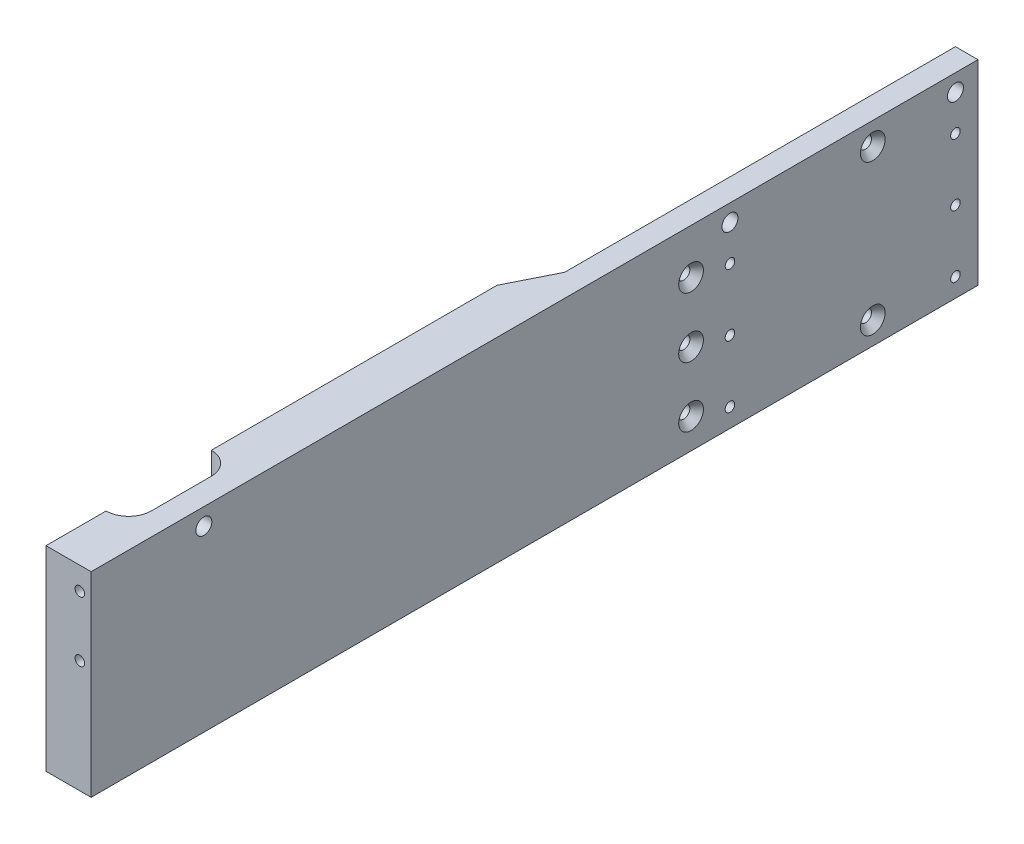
ISO-10303-21;
HEADER;
FILE_DESCRIPTION(('STEP AP214'),'2;1');
FILE_NAME('part.step','',(''),(''),'','','');
FILE_SCHEMA(('AUTOMOTIVE_DESIGN { 1 0 10303 214 1 1 1 1 }'));
ENDSEC;
DATA;
#1=APPLICATION_CONTEXT('core data for automotive mechanical design processes');
#2=APPLICATION_PROTOCOL_DEFINITION('international standard','automotive_design',2000,#1);
#3=PRODUCT_CONTEXT('',#1,'mechanical');
#4=PRODUCT('Part','Part','',(#3));
#5=PRODUCT_RELATED_PRODUCT_CATEGORY('part','',(#4));
#6=PRODUCT_DEFINITION_FORMATION('','',#4);
#7=PRODUCT_DEFINITION_CONTEXT('part definition',#1,'design');
#8=PRODUCT_DEFINITION('design','',#6,#7);
#9=PRODUCT_DEFINITION_SHAPE('','',#8);
#10=(LENGTH_UNIT() NAMED_UNIT(*) SI_UNIT(.MILLI.,.METRE.));
#11=(NAMED_UNIT(*) PLANE_ANGLE_UNIT() SI_UNIT($,.RADIAN.));
#12=(NAMED_UNIT(*) SI_UNIT($,.STERADIAN.) SOLID_ANGLE_UNIT());
#13=UNCERTAINTY_MEASURE_WITH_UNIT(LENGTH_MEASURE(1.E-05),#10,'distance_accuracy_value','');
#14=(GEOMETRIC_REPRESENTATION_CONTEXT(3) GLOBAL_UNCERTAINTY_ASSIGNED_CONTEXT((#13)) GLOBAL_UNIT_ASSIGNED_CONTEXT((#10,
#11,#12)) REPRESENTATION_CONTEXT('',''));
#15=CARTESIAN_POINT('',(0.,0.,0.));
#16=DIRECTION('',(0.,0.,1.));
#17=DIRECTION('',(1.,0.,0.));
#18=AXIS2_PLACEMENT_3D('',#15,#16,#17);
#19=CARTESIAN_POINT('',(72.898,48.4187500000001,-25.4));
#20=DIRECTION('',(1.,0.,0.));
#21=DIRECTION('',(0.,0.,-1.));
#22=AXIS2_PLACEMENT_3D('',#19,#20,#21);
#23=PLANE('',#22);
#24=DIRECTION('',(0.,0.,-1.));
#25=VECTOR('',#24,1.);
#26=CARTESIAN_POINT('',(72.898,-34.1376,-25.4));
#27=LINE('',#26,#25);
#28=CARTESIAN_POINT('',(72.898,-34.1376,-95.2499999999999));
#29=VERTEX_POINT('',#28);
#30=CARTESIAN_POINT('',(72.898,-34.1376,-215.9));
#31=VERTEX_POINT('',#30);
#32=EDGE_CURVE('E199',#29,#31,#27,.T.);
#33=ORIENTED_EDGE('',*,*,#32,.F.);
#34=DIRECTION('',(0.,-1.,0.));
#35=VECTOR('',#34,1.);
#36=CARTESIAN_POINT('',(72.898,48.4188000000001,-95.2499999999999));
#37=LINE('',#36,#35);
#38=CARTESIAN_POINT('',(72.898,48.4187500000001,-95.2499999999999));
#39=VERTEX_POINT('',#38);
#40=EDGE_CURVE('E11',#29,#39,#37,.F.);
#41=ORIENTED_EDGE('',*,*,#40,.T.);
#42=DIRECTION('',(0.,0.,-1.));
#43=VECTOR('',#42,1.);
#44=CARTESIAN_POINT('',(72.898,48.4187500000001,-25.4));
#45=LINE('',#44,#43);
#46=CARTESIAN_POINT('',(72.898,48.4187500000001,-215.9));
#47=VERTEX_POINT('',#46);
#48=EDGE_CURVE('E202',#39,#47,#45,.T.);
#49=ORIENTED_EDGE('',*,*,#48,.T.);
#50=DIRECTION('',(0.,-1.,0.));
#51=VECTOR('',#50,1.);
#52=CARTESIAN_POINT('',(72.898,69.7172974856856,-215.9));
#53=LINE('',#52,#51);
#54=EDGE_CURVE('E217',#47,#31,#53,.T.);
#55=ORIENTED_EDGE('',*,*,#54,.T.);
#56=EDGE_LOOP('',(#33,#41,#49,#55));
#57=FACE_BOUND('',#56,.T.);
#58=ADVANCED_FACE('F42',(#57),#23,.F.);
#59=CARTESIAN_POINT('',(82.423,-34.1376,-215.9));
#60=DIRECTION('',(1.,0.,0.));
#61=DIRECTION('',(0.,0.,-1.));
#62=AXIS2_PLACEMENT_3D('',#59,#60,#61);
#63=PLANE('',#62);
#64=CARTESIAN_POINT('',(82.423,38.8937500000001,-355.6));
#65=DIRECTION('',(1.,0.,0.));
#66=DIRECTION('',(0.,0.,-1.));
#67=AXIS2_PLACEMENT_3D('',#64,#65,#66);
#68=CIRCLE('',#67,2.55269999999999);
#69=CARTESIAN_POINT('',(82.423,38.8937500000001,-358.1527));
#70=VERTEX_POINT('',#69);
#71=EDGE_CURVE('E46',#70,#70,#68,.T.);
#72=ORIENTED_EDGE('',*,*,#71,.T.);
#73=EDGE_LOOP('',(#72));
#74=FACE_BOUND('',#73,.T.);
#75=CARTESIAN_POINT('',(82.423,-24.6126,-355.6));
#76=DIRECTION('',(1.,0.,0.));
#77=DIRECTION('',(0.,0.,-1.));
#78=AXIS2_PLACEMENT_3D('',#75,#76,#77);
#79=CIRCLE('',#78,2.55269999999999);
#80=CARTESIAN_POINT('',(82.423,-24.6126,-358.1527));
#81=VERTEX_POINT('',#80);
#82=EDGE_CURVE('E258',#81,#81,#79,.T.);
#83=ORIENTED_EDGE('',*,*,#82,.T.);
#84=EDGE_LOOP('',(#83));
#85=FACE_BOUND('',#84,.T.);
#86=CARTESIAN_POINT('',(82.423,-21.4376,-278.8412));
#87=DIRECTION('',(1.,0.,0.));
#88=DIRECTION('',(0.,0.,-1.));
#89=AXIS2_PLACEMENT_3D('',#86,#87,#88);
#90=CIRCLE('',#89,2.55269999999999);
#91=CARTESIAN_POINT('',(82.423,-21.4376,-281.3939));
#92=VERTEX_POINT('',#91);
#93=EDGE_CURVE('E254',#92,#92,#90,.T.);
#94=ORIENTED_EDGE('',*,*,#93,.T.);
#95=EDGE_LOOP('',(#94));
#96=FACE_BOUND('',#95,.T.);
#97=CARTESIAN_POINT('',(82.423,3.96239999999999,-278.8412));
#98=DIRECTION('',(1.,0.,0.));
#99=DIRECTION('',(0.,0.,-1.));
#100=AXIS2_PLACEMENT_3D('',#97,#98,#99);
#101=CIRCLE('',#100,2.55269999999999);
#102=CARTESIAN_POINT('',(82.423,3.96239999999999,-281.3939));
#103=VERTEX_POINT('',#102);
#104=EDGE_CURVE('E249',#103,#103,#101,.T.);
#105=ORIENTED_EDGE('',*,*,#104,.T.);
#106=EDGE_LOOP('',(#105));
#107=FACE_BOUND('',#106,.T.);
#108=CARTESIAN_POINT('',(82.423,29.3624,-278.8412));
#109=DIRECTION('',(1.,0.,0.));
#110=DIRECTION('',(0.,0.,-1.));
#111=AXIS2_PLACEMENT_3D('',#108,#109,#110);
#112=CIRCLE('',#111,2.55269999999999);
#113=CARTESIAN_POINT('',(82.423,29.3624,-281.3939));
#114=VERTEX_POINT('',#113);
#115=EDGE_CURVE('E243',#114,#114,#112,.T.);
#116=ORIENTED_EDGE('',*,*,#115,.T.);
#117=EDGE_LOOP('',(#116));
#118=FACE_BOUND('',#117,.T.);
#119=CARTESIAN_POINT('',(82.423,41.275,-390.525));
#120=DIRECTION('',(1.,0.,0.));
#121=DIRECTION('',(0.,0.,-1.));
#122=AXIS2_PLACEMENT_3D('',#119,#120,#121);
#123=CIRCLE('',#122,3.37819999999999);
#124=CARTESIAN_POINT('',(82.423,41.275,-393.9032));
#125=VERTEX_POINT('',#124);
#126=EDGE_CURVE('E209',#125,#125,#123,.T.);
#127=ORIENTED_EDGE('',*,*,#126,.T.);
#128=EDGE_LOOP('',(#127));
#129=FACE_BOUND('',#128,.T.);
#130=CARTESIAN_POINT('',(82.423,41.275,-295.275));
#131=DIRECTION('',(1.,0.,0.));
#132=DIRECTION('',(0.,0.,-1.));
#133=AXIS2_PLACEMENT_3D('',#130,#131,#132);
#134=CIRCLE('',#133,3.37819999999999);
#135=CARTESIAN_POINT('',(82.423,41.275,-298.6532));
#136=VERTEX_POINT('',#135);
#137=EDGE_CURVE('E214',#136,#136,#134,.T.);
#138=ORIENTED_EDGE('',*,*,#137,.T.);
#139=EDGE_LOOP('',(#138));
#140=FACE_BOUND('',#139,.T.);
#141=CARTESIAN_POINT('',(82.423,26.19375,-390.525));
#142=DIRECTION('',(1.,0.,0.));
#143=DIRECTION('',(0.,0.,-1.));
#144=AXIS2_PLACEMENT_3D('',#141,#142,#143);
#145=CIRCLE('',#144,2.0193);
#146=CARTESIAN_POINT('',(82.423,26.19375,-392.5443));
#147=VERTEX_POINT('',#146);
#148=EDGE_CURVE('E441',#147,#147,#145,.T.);
#149=ORIENTED_EDGE('',*,*,#148,.T.);
#150=EDGE_LOOP('',(#149));
#151=FACE_BOUND('',#150,.T.);
#152=CARTESIAN_POINT('',(82.423,-26.19375,-390.525));
#153=DIRECTION('',(1.,0.,0.));
#154=DIRECTION('',(0.,0.,-1.));
#155=AXIS2_PLACEMENT_3D('',#152,#153,#154);
#156=CIRCLE('',#155,2.0193);
#157=CARTESIAN_POINT('',(82.423,-26.19375,-392.5443));
#158=VERTEX_POINT('',#157);
#159=EDGE_CURVE('E445',#158,#158,#156,.T.);
#160=ORIENTED_EDGE('',*,*,#159,.T.);
#161=EDGE_LOOP('',(#160));
#162=FACE_BOUND('',#161,.T.);
#163=CARTESIAN_POINT('',(82.423,26.19375,-295.275));
#164=DIRECTION('',(1.,0.,0.));
#165=DIRECTION('',(0.,0.,-1.));
#166=AXIS2_PLACEMENT_3D('',#163,#164,#165);
#167=CIRCLE('',#166,2.0193);
#168=CARTESIAN_POINT('',(82.423,26.19375,-297.2943));
#169=VERTEX_POINT('',#168);
#170=EDGE_CURVE('E449',#169,#169,#167,.T.);
#171=ORIENTED_EDGE('',*,*,#170,.T.);
#172=EDGE_LOOP('',(#171));
#173=FACE_BOUND('',#172,.T.);
#174=CARTESIAN_POINT('',(82.423,-26.19375,-295.275));
#175=DIRECTION('',(1.,0.,0.));
#176=DIRECTION('',(0.,0.,-1.));
#177=AXIS2_PLACEMENT_3D('',#174,#175,#176);
#178=CIRCLE('',#177,2.0193);
#179=CARTESIAN_POINT('',(82.423,-26.19375,-297.2943));
#180=VERTEX_POINT('',#179);
#181=EDGE_CURVE('E453',#180,#180,#178,.T.);
#182=ORIENTED_EDGE('',*,*,#181,.T.);
#183=EDGE_LOOP('',(#182));
#184=FACE_BOUND('',#183,.T.);
#185=CARTESIAN_POINT('',(82.423,0.,-390.525));
#186=DIRECTION('',(1.,0.,0.));
#187=DIRECTION('',(0.,0.,-1.));
#188=AXIS2_PLACEMENT_3D('',#185,#186,#187);
#189=CIRCLE('',#188,2.0193);
#190=CARTESIAN_POINT('',(82.423,0.,-392.5443));
#191=VERTEX_POINT('',#190);
#192=EDGE_CURVE('E457',#191,#191,#189,.T.);
#193=ORIENTED_EDGE('',*,*,#192,.T.);
#194=EDGE_LOOP('',(#193));
#195=FACE_BOUND('',#194,.T.);
#196=CARTESIAN_POINT('',(82.423,0.,-295.275));
#197=DIRECTION('',(1.,0.,0.));
#198=DIRECTION('',(0.,0.,-1.));
#199=AXIS2_PLACEMENT_3D('',#196,#197,#198);
#200=CIRCLE('',#199,2.0193);
#201=CARTESIAN_POINT('',(82.423,0.,-297.2943));
#202=VERTEX_POINT('',#201);
#203=EDGE_CURVE('E460',#202,#202,#200,.T.);
#204=ORIENTED_EDGE('',*,*,#203,.T.);
#205=EDGE_LOOP('',(#204));
#206=FACE_BOUND('',#205,.T.);
#207=DIRECTION('',(0.,-1.,0.));
#208=VECTOR('',#207,1.);
#209=CARTESIAN_POINT('',(82.423,69.7172974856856,-234.95));
#210=LINE('',#209,#208);
#211=CARTESIAN_POINT('',(82.423,48.4187500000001,-234.95));
#212=VERTEX_POINT('',#211);
#213=CARTESIAN_POINT('',(82.423,-34.1376,-234.95));
#214=VERTEX_POINT('',#213);
#215=EDGE_CURVE('E67',#212,#214,#210,.T.);
#216=ORIENTED_EDGE('',*,*,#215,.F.);
#217=DIRECTION('',(0.,0.,1.));
#218=VECTOR('',#217,1.);
#219=CARTESIAN_POINT('',(82.423,48.4187500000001,-215.9));
#220=LINE('',#219,#218);
#221=CARTESIAN_POINT('',(82.423,48.4187500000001,-400.05));
#222=VERTEX_POINT('',#221);
#223=EDGE_CURVE('E498',#222,#212,#220,.T.);
#224=ORIENTED_EDGE('',*,*,#223,.F.);
#225=DIRECTION('',(0.,1.,0.));
#226=VECTOR('',#225,1.);
#227=CARTESIAN_POINT('',(82.423,48.4187500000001,-400.05));
#228=LINE('',#227,#226);
#229=CARTESIAN_POINT('',(82.423,-34.1376,-400.05));
#230=VERTEX_POINT('',#229);
#231=EDGE_CURVE('E494',#230,#222,#228,.T.);
#232=ORIENTED_EDGE('',*,*,#231,.F.);
#233=DIRECTION('',(0.,0.,-1.));
#234=VECTOR('',#233,1.);
#235=CARTESIAN_POINT('',(82.423,-34.1376,-215.9));
#236=LINE('',#235,#234);
#237=EDGE_CURVE('E223',#214,#230,#236,.T.);
#238=ORIENTED_EDGE('',*,*,#237,.F.);
#239=EDGE_LOOP('',(#216,#224,#232,#238));
#240=FACE_BOUND('',#239,.T.);
#241=ADVANCED_FACE('F311',(#74,#85,#96,#107,#118,#129,#140,#151,#162,#173,#184,#195,#206,#240),
#63,.F.);
#242=CARTESIAN_POINT('',(82.423,48.4187500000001,-215.9));
#243=DIRECTION('',(0.,1.,0.));
#244=DIRECTION('',(0.,0.,1.));
#245=AXIS2_PLACEMENT_3D('',#242,#243,#244);
#246=PLANE('',#245);
#247=CARTESIAN_POINT('',(72.898,48.41875,-85.7249999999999));
#248=DIRECTION('',(0.,1.,0.));
#249=DIRECTION('',(0.,0.,1.));
#250=AXIS2_PLACEMENT_3D('',#247,#248,#249);
#251=CIRCLE('',#250,9.52500000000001);
#252=CARTESIAN_POINT('',(82.423,48.41875,-85.7249999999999));
#253=VERTEX_POINT('',#252);
#254=EDGE_CURVE('E162',#253,#39,#251,.T.);
#255=ORIENTED_EDGE('',*,*,#254,.F.);
#256=DIRECTION('',(0.,0.,-1.));
#257=VECTOR('',#256,1.);
#258=CARTESIAN_POINT('',(82.423,48.4187500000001,-215.9));
#259=LINE('',#258,#257);
#260=CARTESIAN_POINT('',(82.423,48.41875,-60.3249999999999));
#261=VERTEX_POINT('',#260);
#262=EDGE_CURVE('E141',#261,#253,#259,.T.);
#263=ORIENTED_EDGE('',*,*,#262,.F.);
#264=CARTESIAN_POINT('',(72.898,48.41875,-60.3249999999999));
#265=DIRECTION('',(0.,1.,0.));
#266=DIRECTION('',(0.,0.,1.));
#267=AXIS2_PLACEMENT_3D('',#264,#265,#266);
#268=CIRCLE('',#267,9.52500000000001);
#269=CARTESIAN_POINT('',(72.898,48.4187500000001,-50.7999999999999));
#270=VERTEX_POINT('',#269);
#271=EDGE_CURVE('E159',#270,#261,#268,.T.);
#272=ORIENTED_EDGE('',*,*,#271,.F.);
#273=CARTESIAN_POINT('',(72.898,48.4187500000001,-25.4));
#274=VERTEX_POINT('',#273);
#275=EDGE_CURVE('E203',#274,#270,#45,.T.);
#276=ORIENTED_EDGE('',*,*,#275,.F.);
#277=DIRECTION('',(-1.,0.,0.));
#278=VECTOR('',#277,1.);
#279=CARTESIAN_POINT('',(91.948,48.4187500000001,-25.4));
#280=LINE('',#279,#278);
#281=CARTESIAN_POINT('',(91.948,48.4187500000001,-25.4));
#282=VERTEX_POINT('',#281);
#283=EDGE_CURVE('E195',#282,#274,#280,.T.);
#284=ORIENTED_EDGE('',*,*,#283,.F.);
#285=DIRECTION('',(0.,0.,1.));
#286=VECTOR('',#285,1.);
#287=CARTESIAN_POINT('',(91.948,48.4187500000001,-215.9));
#288=LINE('',#287,#286);
#289=CARTESIAN_POINT('',(91.948,48.4187500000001,-400.05));
#290=VERTEX_POINT('',#289);
#291=EDGE_CURVE('E507',#290,#282,#288,.T.);
#292=ORIENTED_EDGE('',*,*,#291,.F.);
#293=DIRECTION('',(1.,0.,0.));
#294=VECTOR('',#293,1.);
#295=CARTESIAN_POINT('',(82.423,48.4187500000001,-400.05));
#296=LINE('',#295,#294);
#297=EDGE_CURVE('E241',#222,#290,#296,.T.);
#298=ORIENTED_EDGE('',*,*,#297,.F.);
#299=ORIENTED_EDGE('',*,*,#223,.T.);
#300=DIRECTION('',(-0.447213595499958,0.,0.894427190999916));
#301=VECTOR('',#300,1.);
#302=CARTESIAN_POINT('',(72.898,48.4187500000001,-215.9));
#303=LINE('',#302,#301);
#304=EDGE_CURVE('E222',#212,#47,#303,.T.);
#305=ORIENTED_EDGE('',*,*,#304,.T.);
#306=ORIENTED_EDGE('',*,*,#48,.F.);
#307=EDGE_LOOP('',(#255,#263,#272,#276,#284,#292,#298,#299,#305,#306));
#308=FACE_BOUND('',#307,.T.);
#309=ADVANCED_FACE('F318',(#308),#246,.T.);
#310=CARTESIAN_POINT('',(82.423,48.4187500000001,-400.05));
#311=DIRECTION('',(0.,0.,-1.));
#312=DIRECTION('',(-1.,0.,0.));
#313=AXIS2_PLACEMENT_3D('',#310,#311,#312);
#314=PLANE('',#313);
#315=DIRECTION('',(0.,1.,0.));
#316=VECTOR('',#315,1.);
#317=CARTESIAN_POINT('',(91.948,48.4187500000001,-400.05));
#318=LINE('',#317,#316);
#319=CARTESIAN_POINT('',(91.948,-34.1376,-400.05));
#320=VERTEX_POINT('',#319);
#321=EDGE_CURVE('E509',#320,#290,#318,.T.);
#322=ORIENTED_EDGE('',*,*,#321,.F.);
#323=DIRECTION('',(1.,0.,0.));
#324=VECTOR('',#323,1.);
#325=CARTESIAN_POINT('',(82.423,-34.1376,-400.05));
#326=LINE('',#325,#324);
#327=EDGE_CURVE('E504',#230,#320,#326,.T.);
#328=ORIENTED_EDGE('',*,*,#327,.F.);
#329=ORIENTED_EDGE('',*,*,#231,.T.);
#330=ORIENTED_EDGE('',*,*,#297,.T.);
#331=EDGE_LOOP('',(#322,#328,#329,#330));
#332=FACE_BOUND('',#331,.T.);
#333=ADVANCED_FACE('F387',(#332),#314,.T.);
#334=CARTESIAN_POINT('',(82.423,-34.1376,-215.9));
#335=DIRECTION('',(0.,-1.,0.));
#336=DIRECTION('',(0.,0.,-1.));
#337=AXIS2_PLACEMENT_3D('',#334,#335,#336);
#338=PLANE('',#337);
#339=CARTESIAN_POINT('',(72.898,-34.1376,-85.7249999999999));
#340=DIRECTION('',(0.,-1.,0.));
#341=DIRECTION('',(0.,0.,-1.));
#342=AXIS2_PLACEMENT_3D('',#339,#340,#341);
#343=CIRCLE('',#342,9.52500000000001);
#344=CARTESIAN_POINT('',(82.423,-34.1376,-85.7249999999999));
#345=VERTEX_POINT('',#344);
#346=EDGE_CURVE('E147',#29,#345,#343,.T.);
#347=ORIENTED_EDGE('',*,*,#346,.F.);
#348=ORIENTED_EDGE('',*,*,#32,.T.);
#349=DIRECTION('',(-0.447213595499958,0.,0.894427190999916));
#350=VECTOR('',#349,1.);
#351=CARTESIAN_POINT('',(72.898,-34.1376,-215.9));
#352=LINE('',#351,#350);
#353=EDGE_CURVE('E226',#214,#31,#352,.T.);
#354=ORIENTED_EDGE('',*,*,#353,.F.);
#355=ORIENTED_EDGE('',*,*,#237,.T.);
#356=ORIENTED_EDGE('',*,*,#327,.T.);
#357=DIRECTION('',(0.,0.,-1.));
#358=VECTOR('',#357,1.);
#359=CARTESIAN_POINT('',(91.948,-34.1376,-215.9));
#360=LINE('',#359,#358);
#361=CARTESIAN_POINT('',(91.948,-34.1376,-25.4));
#362=VERTEX_POINT('',#361);
#363=EDGE_CURVE('E491',#362,#320,#360,.T.);
#364=ORIENTED_EDGE('',*,*,#363,.F.);
#365=DIRECTION('',(1.,0.,0.));
#366=VECTOR('',#365,1.);
#367=CARTESIAN_POINT('',(72.898,-34.1376,-25.4));
#368=LINE('',#367,#366);
#369=CARTESIAN_POINT('',(72.898,-34.1376,-25.4));
#370=VERTEX_POINT('',#369);
#371=EDGE_CURVE('E189',#370,#362,#368,.T.);
#372=ORIENTED_EDGE('',*,*,#371,.F.);
#373=CARTESIAN_POINT('',(72.898,-34.1376,-50.7999999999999));
#374=VERTEX_POINT('',#373);
#375=EDGE_CURVE('E200',#370,#374,#27,.T.);
#376=ORIENTED_EDGE('',*,*,#375,.T.);
#377=CARTESIAN_POINT('',(72.898,-34.1376,-60.3249999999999));
#378=DIRECTION('',(0.,-1.,0.));
#379=DIRECTION('',(0.,0.,-1.));
#380=AXIS2_PLACEMENT_3D('',#377,#378,#379);
#381=CIRCLE('',#380,9.52500000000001);
#382=CARTESIAN_POINT('',(82.423,-34.1376,-60.3249999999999));
#383=VERTEX_POINT('',#382);
#384=EDGE_CURVE('E59',#383,#374,#381,.T.);
#385=ORIENTED_EDGE('',*,*,#384,.F.);
#386=DIRECTION('',(0.,0.,1.));
#387=VECTOR('',#386,1.);
#388=CARTESIAN_POINT('',(82.423,-34.1376,-85.7249999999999));
#389=LINE('',#388,#387);
#390=EDGE_CURVE('E139',#345,#383,#389,.T.);
#391=ORIENTED_EDGE('',*,*,#390,.F.);
#392=EDGE_LOOP('',(#347,#348,#354,#355,#356,#364,#372,#376,#385,#391));
#393=FACE_BOUND('',#392,.T.);
#394=CARTESIAN_POINT('',(87.1855,-34.1376,-66.675));
#395=DIRECTION('',(0.,-1.,0.));
#396=DIRECTION('',(0.,0.,-1.));
#397=AXIS2_PLACEMENT_3D('',#394,#395,#396);
#398=CIRCLE('',#397,2.01929999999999);
#399=CARTESIAN_POINT('',(87.1855,-34.1376,-68.6943));
#400=VERTEX_POINT('',#399);
#401=EDGE_CURVE('E177',#400,#400,#398,.T.);
#402=ORIENTED_EDGE('',*,*,#401,.F.);
#403=EDGE_LOOP('',(#402));
#404=FACE_BOUND('',#403,.T.);
#405=CARTESIAN_POINT('',(87.1855,-34.1376,-149.225));
#406=DIRECTION('',(0.,-1.,0.));
#407=DIRECTION('',(0.,0.,-1.));
#408=AXIS2_PLACEMENT_3D('',#405,#406,#407);
#409=CIRCLE('',#408,2.01929999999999);
#410=CARTESIAN_POINT('',(87.1855,-34.1376,-151.2443));
#411=VERTEX_POINT('',#410);
#412=EDGE_CURVE('E183',#411,#411,#409,.T.);
#413=ORIENTED_EDGE('',*,*,#412,.F.);
#414=EDGE_LOOP('',(#413));
#415=FACE_BOUND('',#414,.T.);
#416=ADVANCED_FACE('F44',(#393,#404,#415),#338,.T.);
#417=CARTESIAN_POINT('',(91.948,-34.1376,-215.9));
#418=DIRECTION('',(1.,0.,0.));
#419=DIRECTION('',(0.,0.,-1.));
#420=AXIS2_PLACEMENT_3D('',#417,#418,#419);
#421=PLANE('',#420);
#422=CARTESIAN_POINT('',(91.948,38.8937500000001,-355.6));
#423=DIRECTION('',(1.,0.,0.));
#424=DIRECTION('',(0.,0.,-1.));
#425=AXIS2_PLACEMENT_3D('',#422,#423,#424);
#426=CIRCLE('',#425,5.2197);
#427=CARTESIAN_POINT('',(91.948,38.8937500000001,-360.8197));
#428=VERTEX_POINT('',#427);
#429=EDGE_CURVE('E776',#428,#428,#426,.T.);
#430=ORIENTED_EDGE('',*,*,#429,.F.);
#431=EDGE_LOOP('',(#430));
#432=FACE_BOUND('',#431,.T.);
#433=CARTESIAN_POINT('',(91.948,-24.6126,-355.6));
#434=DIRECTION('',(1.,0.,0.));
#435=DIRECTION('',(0.,0.,-1.));
#436=AXIS2_PLACEMENT_3D('',#433,#434,#435);
#437=CIRCLE('',#436,5.2197);
#438=CARTESIAN_POINT('',(91.948,-24.6126,-360.8197));
#439=VERTEX_POINT('',#438);
#440=EDGE_CURVE('E268',#439,#439,#437,.T.);
#441=ORIENTED_EDGE('',*,*,#440,.F.);
#442=EDGE_LOOP('',(#441));
#443=FACE_BOUND('',#442,.T.);
#444=CARTESIAN_POINT('',(91.948,-21.4376,-278.8412));
#445=DIRECTION('',(1.,0.,0.));
#446=DIRECTION('',(0.,0.,-1.));
#447=AXIS2_PLACEMENT_3D('',#444,#445,#446);
#448=CIRCLE('',#447,5.2197);
#449=CARTESIAN_POINT('',(91.948,-21.4376,-284.0609));
#450=VERTEX_POINT('',#449);
#451=EDGE_CURVE('E260',#450,#450,#448,.T.);
#452=ORIENTED_EDGE('',*,*,#451,.F.);
#453=EDGE_LOOP('',(#452));
#454=FACE_BOUND('',#453,.T.);
#455=CARTESIAN_POINT('',(91.948,3.96239999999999,-278.8412));
#456=DIRECTION('',(1.,0.,0.));
#457=DIRECTION('',(0.,0.,-1.));
#458=AXIS2_PLACEMENT_3D('',#455,#456,#457);
#459=CIRCLE('',#458,5.2197);
#460=CARTESIAN_POINT('',(91.948,3.96239999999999,-284.0609));
#461=VERTEX_POINT('',#460);
#462=EDGE_CURVE('E256',#461,#461,#459,.T.);
#463=ORIENTED_EDGE('',*,*,#462,.F.);
#464=EDGE_LOOP('',(#463));
#465=FACE_BOUND('',#464,.T.);
#466=CARTESIAN_POINT('',(91.948,29.3624,-278.8412));
#467=DIRECTION('',(1.,0.,0.));
#468=DIRECTION('',(0.,0.,-1.));
#469=AXIS2_PLACEMENT_3D('',#466,#467,#468);
#470=CIRCLE('',#469,5.2197);
#471=CARTESIAN_POINT('',(91.948,29.3624,-284.0609));
#472=VERTEX_POINT('',#471);
#473=EDGE_CURVE('E252',#472,#472,#470,.T.);
#474=ORIENTED_EDGE('',*,*,#473,.F.);
#475=EDGE_LOOP('',(#474));
#476=FACE_BOUND('',#475,.T.);
#477=CARTESIAN_POINT('',(91.948,41.275,-73.025));
#478=DIRECTION('',(1.,0.,0.));
#479=DIRECTION('',(0.,0.,-1.));
#480=AXIS2_PLACEMENT_3D('',#477,#478,#479);
#481=CIRCLE('',#480,3.3782);
#482=CARTESIAN_POINT('',(91.948,41.275,-76.4032));
#483=VERTEX_POINT('',#482);
#484=EDGE_CURVE('E247',#483,#483,#481,.T.);
#485=ORIENTED_EDGE('',*,*,#484,.F.);
#486=EDGE_LOOP('',(#485));
#487=FACE_BOUND('',#486,.T.);
#488=CARTESIAN_POINT('',(91.948,41.275,-390.525));
#489=DIRECTION('',(1.,0.,0.));
#490=DIRECTION('',(0.,0.,-1.));
#491=AXIS2_PLACEMENT_3D('',#488,#489,#490);
#492=CIRCLE('',#491,3.37819999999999);
#493=CARTESIAN_POINT('',(91.948,41.275,-393.9032));
#494=VERTEX_POINT('',#493);
#495=EDGE_CURVE('E206',#494,#494,#492,.T.);
#496=ORIENTED_EDGE('',*,*,#495,.F.);
#497=EDGE_LOOP('',(#496));
#498=FACE_BOUND('',#497,.T.);
#499=CARTESIAN_POINT('',(91.948,41.275,-295.275));
#500=DIRECTION('',(1.,0.,0.));
#501=DIRECTION('',(0.,0.,-1.));
#502=AXIS2_PLACEMENT_3D('',#499,#500,#501);
#503=CIRCLE('',#502,3.37819999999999);
#504=CARTESIAN_POINT('',(91.948,41.275,-298.6532));
#505=VERTEX_POINT('',#504);
#506=EDGE_CURVE('E210',#505,#505,#503,.T.);
#507=ORIENTED_EDGE('',*,*,#506,.F.);
#508=EDGE_LOOP('',(#507));
#509=FACE_BOUND('',#508,.T.);
#510=CARTESIAN_POINT('',(91.948,0.,-295.275));
#511=DIRECTION('',(1.,0.,0.));
#512=DIRECTION('',(0.,0.,-1.));
#513=AXIS2_PLACEMENT_3D('',#510,#511,#512);
#514=CIRCLE('',#513,2.01929999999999);
#515=CARTESIAN_POINT('',(91.948,0.,-297.2943));
#516=VERTEX_POINT('',#515);
#517=EDGE_CURVE('E233',#516,#516,#514,.T.);
#518=ORIENTED_EDGE('',*,*,#517,.F.);
#519=EDGE_LOOP('',(#518));
#520=FACE_BOUND('',#519,.T.);
#521=CARTESIAN_POINT('',(91.948,0.,-390.525));
#522=DIRECTION('',(1.,0.,0.));
#523=DIRECTION('',(0.,0.,-1.));
#524=AXIS2_PLACEMENT_3D('',#521,#522,#523);
#525=CIRCLE('',#524,2.01929999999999);
#526=CARTESIAN_POINT('',(91.948,0.,-392.5443));
#527=VERTEX_POINT('',#526);
#528=EDGE_CURVE('E462',#527,#527,#525,.T.);
#529=ORIENTED_EDGE('',*,*,#528,.F.);
#530=EDGE_LOOP('',(#529));
#531=FACE_BOUND('',#530,.T.);
#532=CARTESIAN_POINT('',(91.948,-26.19375,-295.275));
#533=DIRECTION('',(1.,0.,0.));
#534=DIRECTION('',(0.,0.,-1.));
#535=AXIS2_PLACEMENT_3D('',#532,#533,#534);
#536=CIRCLE('',#535,2.01929999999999);
#537=CARTESIAN_POINT('',(91.948,-26.19375,-297.2943));
#538=VERTEX_POINT('',#537);
#539=EDGE_CURVE('E472',#538,#538,#536,.T.);
#540=ORIENTED_EDGE('',*,*,#539,.F.);
#541=EDGE_LOOP('',(#540));
#542=FACE_BOUND('',#541,.T.);
#543=CARTESIAN_POINT('',(91.948,26.19375,-295.275));
#544=DIRECTION('',(1.,0.,0.));
#545=DIRECTION('',(0.,0.,-1.));
#546=AXIS2_PLACEMENT_3D('',#543,#544,#545);
#547=CIRCLE('',#546,2.01929999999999);
#548=CARTESIAN_POINT('',(91.948,26.19375,-297.2943));
#549=VERTEX_POINT('',#548);
#550=EDGE_CURVE('E478',#549,#549,#547,.T.);
#551=ORIENTED_EDGE('',*,*,#550,.F.);
#552=EDGE_LOOP('',(#551));
#553=FACE_BOUND('',#552,.T.);
#554=CARTESIAN_POINT('',(91.948,-26.19375,-390.525));
#555=DIRECTION('',(1.,0.,0.));
#556=DIRECTION('',(0.,0.,-1.));
#557=AXIS2_PLACEMENT_3D('',#554,#555,#556);
#558=CIRCLE('',#557,2.01929999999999);
#559=CARTESIAN_POINT('',(91.948,-26.19375,-392.5443));
#560=VERTEX_POINT('',#559);
#561=EDGE_CURVE('E483',#560,#560,#558,.T.);
#562=ORIENTED_EDGE('',*,*,#561,.F.);
#563=EDGE_LOOP('',(#562));
#564=FACE_BOUND('',#563,.T.);
#565=CARTESIAN_POINT('',(91.948,26.19375,-390.525));
#566=DIRECTION('',(1.,0.,0.));
#567=DIRECTION('',(0.,0.,-1.));
#568=AXIS2_PLACEMENT_3D('',#565,#566,#567);
#569=CIRCLE('',#568,2.01929999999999);
#570=CARTESIAN_POINT('',(91.948,26.19375,-392.5443));
#571=VERTEX_POINT('',#570);
#572=EDGE_CURVE('E488',#571,#571,#569,.T.);
#573=ORIENTED_EDGE('',*,*,#572,.F.);
#574=EDGE_LOOP('',(#573));
#575=FACE_BOUND('',#574,.T.);
#576=ORIENTED_EDGE('',*,*,#291,.T.);
#577=DIRECTION('',(0.,1.,0.));
#578=VECTOR('',#577,1.);
#579=CARTESIAN_POINT('',(91.948,-34.1376,-25.4));
#580=LINE('',#579,#578);
#581=EDGE_CURVE('E192',#362,#282,#580,.T.);
#582=ORIENTED_EDGE('',*,*,#581,.F.);
#583=ORIENTED_EDGE('',*,*,#363,.T.);
#584=ORIENTED_EDGE('',*,*,#321,.T.);
#585=EDGE_LOOP('',(#576,#582,#583,#584));
#586=FACE_BOUND('',#585,.T.);
#587=ADVANCED_FACE('F386',(#432,#443,#454,#465,#476,#487,#498,#509,#520,#531,#542,#553,#564,
#575,#586),#421,.T.);
#588=CARTESIAN_POINT('',(91.948,26.19375,-390.525));
#589=DIRECTION('',(1.,0.,0.));
#590=DIRECTION('',(0.,0.,-1.));
#591=AXIS2_PLACEMENT_3D('',#588,#589,#590);
#592=CYLINDRICAL_SURFACE('',#591,2.01929999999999);
#593=ORIENTED_EDGE('',*,*,#148,.F.);
#594=EDGE_LOOP('',(#593));
#595=FACE_BOUND('',#594,.T.);
#596=ORIENTED_EDGE('',*,*,#572,.T.);
#597=EDGE_LOOP('',(#596));
#598=FACE_BOUND('',#597,.T.);
#599=ADVANCED_FACE('F392',(#595,#598),#592,.F.);
#600=CARTESIAN_POINT('',(91.948,-26.19375,-390.525));
#601=DIRECTION('',(1.,0.,0.));
#602=DIRECTION('',(0.,0.,-1.));
#603=AXIS2_PLACEMENT_3D('',#600,#601,#602);
#604=CYLINDRICAL_SURFACE('',#603,2.01929999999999);
#605=ORIENTED_EDGE('',*,*,#159,.F.);
#606=EDGE_LOOP('',(#605));
#607=FACE_BOUND('',#606,.T.);
#608=ORIENTED_EDGE('',*,*,#561,.T.);
#609=EDGE_LOOP('',(#608));
#610=FACE_BOUND('',#609,.T.);
#611=ADVANCED_FACE('F404',(#607,#610),#604,.F.);
#612=CARTESIAN_POINT('',(91.948,26.19375,-295.275));
#613=DIRECTION('',(1.,0.,0.));
#614=DIRECTION('',(0.,0.,-1.));
#615=AXIS2_PLACEMENT_3D('',#612,#613,#614);
#616=CYLINDRICAL_SURFACE('',#615,2.01929999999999);
#617=ORIENTED_EDGE('',*,*,#170,.F.);
#618=EDGE_LOOP('',(#617));
#619=FACE_BOUND('',#618,.T.);
#620=ORIENTED_EDGE('',*,*,#550,.T.);
#621=EDGE_LOOP('',(#620));
#622=FACE_BOUND('',#621,.T.);
#623=ADVANCED_FACE('F408',(#619,#622),#616,.F.);
#624=CARTESIAN_POINT('',(91.948,-26.19375,-295.275));
#625=DIRECTION('',(1.,0.,0.));
#626=DIRECTION('',(0.,0.,-1.));
#627=AXIS2_PLACEMENT_3D('',#624,#625,#626);
#628=CYLINDRICAL_SURFACE('',#627,2.01929999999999);
#629=ORIENTED_EDGE('',*,*,#181,.F.);
#630=EDGE_LOOP('',(#629));
#631=FACE_BOUND('',#630,.T.);
#632=ORIENTED_EDGE('',*,*,#539,.T.);
#633=EDGE_LOOP('',(#632));
#634=FACE_BOUND('',#633,.T.);
#635=ADVANCED_FACE('F412',(#631,#634),#628,.F.);
#636=CARTESIAN_POINT('',(91.948,0.,-390.525));
#637=DIRECTION('',(1.,0.,0.));
#638=DIRECTION('',(0.,0.,-1.));
#639=AXIS2_PLACEMENT_3D('',#636,#637,#638);
#640=CYLINDRICAL_SURFACE('',#639,2.01929999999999);
#641=ORIENTED_EDGE('',*,*,#192,.F.);
#642=EDGE_LOOP('',(#641));
#643=FACE_BOUND('',#642,.T.);
#644=ORIENTED_EDGE('',*,*,#528,.T.);
#645=EDGE_LOOP('',(#644));
#646=FACE_BOUND('',#645,.T.);
#647=ADVANCED_FACE('F416',(#643,#646),#640,.F.);
#648=CARTESIAN_POINT('',(91.948,0.,-295.275));
#649=DIRECTION('',(1.,0.,0.));
#650=DIRECTION('',(0.,0.,-1.));
#651=AXIS2_PLACEMENT_3D('',#648,#649,#650);
#652=CYLINDRICAL_SURFACE('',#651,2.01929999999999);
#653=ORIENTED_EDGE('',*,*,#203,.F.);
#654=EDGE_LOOP('',(#653));
#655=FACE_BOUND('',#654,.T.);
#656=ORIENTED_EDGE('',*,*,#517,.T.);
#657=EDGE_LOOP('',(#656));
#658=FACE_BOUND('',#657,.T.);
#659=ADVANCED_FACE('F420',(#655,#658),#652,.F.);
#660=CARTESIAN_POINT('',(72.898,69.7172974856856,-215.9));
#661=DIRECTION('',(0.894427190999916,0.,0.447213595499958));
#662=DIRECTION('',(0.447213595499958,0.,-0.894427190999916));
#663=AXIS2_PLACEMENT_3D('',#660,#661,#662);
#664=PLANE('',#663);
#665=ORIENTED_EDGE('',*,*,#304,.F.);
#666=ORIENTED_EDGE('',*,*,#215,.T.);
#667=ORIENTED_EDGE('',*,*,#353,.T.);
#668=ORIENTED_EDGE('',*,*,#54,.F.);
#669=EDGE_LOOP('',(#665,#666,#667,#668));
#670=FACE_BOUND('',#669,.T.);
#671=ADVANCED_FACE('F424',(#670),#664,.F.);
#672=CARTESIAN_POINT('',(91.948,41.275,-295.275));
#673=DIRECTION('',(1.,0.,0.));
#674=DIRECTION('',(0.,0.,-1.));
#675=AXIS2_PLACEMENT_3D('',#672,#673,#674);
#676=CYLINDRICAL_SURFACE('',#675,3.37819999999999);
#677=ORIENTED_EDGE('',*,*,#506,.T.);
#678=EDGE_LOOP('',(#677));
#679=FACE_BOUND('',#678,.T.);
#680=ORIENTED_EDGE('',*,*,#137,.F.);
#681=EDGE_LOOP('',(#680));
#682=FACE_BOUND('',#681,.T.);
#683=ADVANCED_FACE('F333',(#679,#682),#676,.F.);
#684=CARTESIAN_POINT('',(91.948,41.275,-390.525));
#685=DIRECTION('',(1.,0.,0.));
#686=DIRECTION('',(0.,0.,-1.));
#687=AXIS2_PLACEMENT_3D('',#684,#685,#686);
#688=CYLINDRICAL_SURFACE('',#687,3.37819999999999);
#689=ORIENTED_EDGE('',*,*,#495,.T.);
#690=EDGE_LOOP('',(#689));
#691=FACE_BOUND('',#690,.T.);
#692=ORIENTED_EDGE('',*,*,#126,.F.);
#693=EDGE_LOOP('',(#692));
#694=FACE_BOUND('',#693,.T.);
#695=ADVANCED_FACE('F325',(#691,#694),#688,.F.);
#696=ORIENTED_EDGE('',*,*,#275,.T.);
#697=DIRECTION('',(0.,-1.,0.));
#698=VECTOR('',#697,1.);
#699=CARTESIAN_POINT('',(72.898,48.4188000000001,-50.7999999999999));
#700=LINE('',#699,#698);
#701=EDGE_CURVE('E51',#270,#374,#700,.T.);
#702=ORIENTED_EDGE('',*,*,#701,.T.);
#703=ORIENTED_EDGE('',*,*,#375,.F.);
#704=DIRECTION('',(0.,-1.,0.));
#705=VECTOR('',#704,1.);
#706=CARTESIAN_POINT('',(72.898,48.4187500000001,-25.4));
#707=LINE('',#706,#705);
#708=EDGE_CURVE('E197',#274,#370,#707,.T.);
#709=ORIENTED_EDGE('',*,*,#708,.F.);
#710=EDGE_LOOP('',(#696,#702,#703,#709));
#711=FACE_BOUND('',#710,.T.);
#712=ADVANCED_FACE('F314',(#711),#23,.F.);
#713=CARTESIAN_POINT('',(91.948,-34.1376,-25.4));
#714=DIRECTION('',(0.,0.,1.));
#715=DIRECTION('',(1.,0.,0.));
#716=AXIS2_PLACEMENT_3D('',#713,#714,#715);
#717=PLANE('',#716);
#718=CARTESIAN_POINT('',(87.1855,13.4874,-25.4));
#719=DIRECTION('',(0.,0.,1.));
#720=DIRECTION('',(1.,0.,0.));
#721=AXIS2_PLACEMENT_3D('',#718,#719,#720);
#722=CIRCLE('',#721,2.01929999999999);
#723=CARTESIAN_POINT('',(89.2048,13.4874,-25.4));
#724=VERTEX_POINT('',#723);
#725=EDGE_CURVE('E165',#724,#724,#722,.T.);
#726=ORIENTED_EDGE('',*,*,#725,.F.);
#727=EDGE_LOOP('',(#726));
#728=FACE_BOUND('',#727,.T.);
#729=CARTESIAN_POINT('',(87.1855,38.8874,-25.4));
#730=DIRECTION('',(0.,0.,1.));
#731=DIRECTION('',(1.,0.,0.));
#732=AXIS2_PLACEMENT_3D('',#729,#730,#731);
#733=CIRCLE('',#732,2.01929999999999);
#734=CARTESIAN_POINT('',(89.2048,38.8874,-25.4));
#735=VERTEX_POINT('',#734);
#736=EDGE_CURVE('E171',#735,#735,#733,.T.);
#737=ORIENTED_EDGE('',*,*,#736,.F.);
#738=EDGE_LOOP('',(#737));
#739=FACE_BOUND('',#738,.T.);
#740=ORIENTED_EDGE('',*,*,#371,.T.);
#741=ORIENTED_EDGE('',*,*,#581,.T.);
#742=ORIENTED_EDGE('',*,*,#283,.T.);
#743=ORIENTED_EDGE('',*,*,#708,.T.);
#744=EDGE_LOOP('',(#740,#741,#742,#743));
#745=FACE_BOUND('',#744,.T.);
#746=ADVANCED_FACE('F324',(#728,#739,#745),#717,.T.);
#747=CARTESIAN_POINT('',(87.1855,-21.4376,-149.225));
#748=DIRECTION('',(0.,-1.,0.));
#749=DIRECTION('',(0.,0.,-1.));
#750=AXIS2_PLACEMENT_3D('',#747,#748,#749);
#751=CONICAL_SURFACE('',#750,2.01929999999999,1.02974425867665);
#752=CARTESIAN_POINT('',(87.1855,-20.2242821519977,-149.225));
#753=VERTEX_POINT('',#752);
#754=VERTEX_LOOP('',#753);
#755=FACE_BOUND('',#754,.T.);
#756=CARTESIAN_POINT('',(87.1855,-21.4376,-149.225));
#757=DIRECTION('',(0.,-1.,0.));
#758=DIRECTION('',(0.,0.,-1.));
#759=AXIS2_PLACEMENT_3D('',#756,#757,#758);
#760=CIRCLE('',#759,2.01929999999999);
#761=CARTESIAN_POINT('',(87.1855,-21.4376,-151.2443));
#762=VERTEX_POINT('',#761);
#763=EDGE_CURVE('E186',#762,#762,#760,.T.);
#764=ORIENTED_EDGE('',*,*,#763,.T.);
#765=EDGE_LOOP('',(#764));
#766=FACE_BOUND('',#765,.T.);
#767=ADVANCED_FACE('F331',(#755,#766),#751,.F.);
#768=CARTESIAN_POINT('',(87.1855,-34.1376,-149.225));
#769=DIRECTION('',(0.,-1.,0.));
#770=DIRECTION('',(0.,0.,-1.));
#771=AXIS2_PLACEMENT_3D('',#768,#769,#770);
#772=CYLINDRICAL_SURFACE('',#771,2.01929999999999);
#773=ORIENTED_EDGE('',*,*,#763,.F.);
#774=EDGE_LOOP('',(#773));
#775=FACE_BOUND('',#774,.T.);
#776=ORIENTED_EDGE('',*,*,#412,.T.);
#777=EDGE_LOOP('',(#776));
#778=FACE_BOUND('',#777,.T.);
#779=ADVANCED_FACE('F371',(#775,#778),#772,.F.);
#780=CARTESIAN_POINT('',(87.1855,-21.4376,-66.675));
#781=DIRECTION('',(0.,-1.,0.));
#782=DIRECTION('',(0.,0.,-1.));
#783=AXIS2_PLACEMENT_3D('',#780,#781,#782);
#784=CONICAL_SURFACE('',#783,2.01929999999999,1.02974425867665);
#785=CARTESIAN_POINT('',(87.1855,-20.2242821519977,-66.675));
#786=VERTEX_POINT('',#785);
#787=VERTEX_LOOP('',#786);
#788=FACE_BOUND('',#787,.T.);
#789=CARTESIAN_POINT('',(87.1855,-21.4376,-66.675));
#790=DIRECTION('',(0.,-1.,0.));
#791=DIRECTION('',(0.,0.,-1.));
#792=AXIS2_PLACEMENT_3D('',#789,#790,#791);
#793=CIRCLE('',#792,2.01929999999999);
#794=CARTESIAN_POINT('',(87.1855,-21.4376,-68.6943));
#795=VERTEX_POINT('',#794);
#796=EDGE_CURVE('E180',#795,#795,#793,.T.);
#797=ORIENTED_EDGE('',*,*,#796,.T.);
#798=EDGE_LOOP('',(#797));
#799=FACE_BOUND('',#798,.T.);
#800=ADVANCED_FACE('F367',(#788,#799),#784,.F.);
#801=CARTESIAN_POINT('',(87.1855,-34.1376,-66.675));
#802=DIRECTION('',(0.,-1.,0.));
#803=DIRECTION('',(0.,0.,-1.));
#804=AXIS2_PLACEMENT_3D('',#801,#802,#803);
#805=CYLINDRICAL_SURFACE('',#804,2.01929999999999);
#806=ORIENTED_EDGE('',*,*,#796,.F.);
#807=EDGE_LOOP('',(#806));
#808=FACE_BOUND('',#807,.T.);
#809=ORIENTED_EDGE('',*,*,#401,.T.);
#810=EDGE_LOOP('',(#809));
#811=FACE_BOUND('',#810,.T.);
#812=ADVANCED_FACE('F363',(#808,#811),#805,.F.);
#813=CARTESIAN_POINT('',(87.1855,38.8874,-47.625));
#814=DIRECTION('',(0.,0.,1.));
#815=DIRECTION('',(1.,0.,0.));
#816=AXIS2_PLACEMENT_3D('',#813,#814,#815);
#817=CONICAL_SURFACE('',#816,2.0193,1.02974425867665);
#818=CARTESIAN_POINT('',(87.1855,38.8874,-48.8383178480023));
#819=VERTEX_POINT('',#818);
#820=VERTEX_LOOP('',#819);
#821=FACE_BOUND('',#820,.T.);
#822=CARTESIAN_POINT('',(87.1855,38.8874,-47.625));
#823=DIRECTION('',(0.,0.,1.));
#824=DIRECTION('',(1.,0.,0.));
#825=AXIS2_PLACEMENT_3D('',#822,#823,#824);
#826=CIRCLE('',#825,2.0193);
#827=CARTESIAN_POINT('',(89.2048,38.8874,-47.625));
#828=VERTEX_POINT('',#827);
#829=EDGE_CURVE('E174',#828,#828,#826,.T.);
#830=ORIENTED_EDGE('',*,*,#829,.T.);
#831=EDGE_LOOP('',(#830));
#832=FACE_BOUND('',#831,.T.);
#833=ADVANCED_FACE('F359',(#821,#832),#817,.F.);
#834=CARTESIAN_POINT('',(87.1855,38.8874,-25.4));
#835=DIRECTION('',(0.,0.,1.));
#836=DIRECTION('',(1.,0.,0.));
#837=AXIS2_PLACEMENT_3D('',#834,#835,#836);
#838=CYLINDRICAL_SURFACE('',#837,2.01929999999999);
#839=ORIENTED_EDGE('',*,*,#829,.F.);
#840=EDGE_LOOP('',(#839));
#841=FACE_BOUND('',#840,.T.);
#842=ORIENTED_EDGE('',*,*,#736,.T.);
#843=EDGE_LOOP('',(#842));
#844=FACE_BOUND('',#843,.T.);
#845=ADVANCED_FACE('F355',(#841,#844),#838,.F.);
#846=CARTESIAN_POINT('',(87.1855,13.4874,-47.625));
#847=DIRECTION('',(0.,0.,1.));
#848=DIRECTION('',(1.,0.,0.));
#849=AXIS2_PLACEMENT_3D('',#846,#847,#848);
#850=CONICAL_SURFACE('',#849,2.0193,1.02974425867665);
#851=CARTESIAN_POINT('',(87.1855,13.4874,-48.8383178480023));
#852=VERTEX_POINT('',#851);
#853=VERTEX_LOOP('',#852);
#854=FACE_BOUND('',#853,.T.);
#855=CARTESIAN_POINT('',(87.1855,13.4874,-47.625));
#856=DIRECTION('',(0.,0.,1.));
#857=DIRECTION('',(1.,0.,0.));
#858=AXIS2_PLACEMENT_3D('',#855,#856,#857);
#859=CIRCLE('',#858,2.0193);
#860=CARTESIAN_POINT('',(89.2048,13.4874,-47.625));
#861=VERTEX_POINT('',#860);
#862=EDGE_CURVE('E168',#861,#861,#859,.T.);
#863=ORIENTED_EDGE('',*,*,#862,.T.);
#864=EDGE_LOOP('',(#863));
#865=FACE_BOUND('',#864,.T.);
#866=ADVANCED_FACE('F351',(#854,#865),#850,.F.);
#867=CARTESIAN_POINT('',(87.1855,13.4874,-25.4));
#868=DIRECTION('',(0.,0.,1.));
#869=DIRECTION('',(1.,0.,0.));
#870=AXIS2_PLACEMENT_3D('',#867,#868,#869);
#871=CYLINDRICAL_SURFACE('',#870,2.01929999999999);
#872=ORIENTED_EDGE('',*,*,#862,.F.);
#873=EDGE_LOOP('',(#872));
#874=FACE_BOUND('',#873,.T.);
#875=ORIENTED_EDGE('',*,*,#725,.T.);
#876=EDGE_LOOP('',(#875));
#877=FACE_BOUND('',#876,.T.);
#878=ADVANCED_FACE('F346',(#874,#877),#871,.F.);
#879=CARTESIAN_POINT('',(72.898,48.4188000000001,-85.7249999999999));
#880=DIRECTION('',(0.,-1.,0.));
#881=DIRECTION('',(0.,0.,-1.));
#882=AXIS2_PLACEMENT_3D('',#879,#880,#881);
#883=CYLINDRICAL_SURFACE('',#882,9.52500000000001);
#884=ORIENTED_EDGE('',*,*,#254,.T.);
#885=ORIENTED_EDGE('',*,*,#40,.F.);
#886=ORIENTED_EDGE('',*,*,#346,.T.);
#887=DIRECTION('',(0.,-1.,0.));
#888=VECTOR('',#887,1.);
#889=CARTESIAN_POINT('',(82.423,48.4188000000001,-85.7249999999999));
#890=LINE('',#889,#888);
#891=EDGE_CURVE('E134',#253,#345,#890,.T.);
#892=ORIENTED_EDGE('',*,*,#891,.F.);
#893=EDGE_LOOP('',(#884,#885,#886,#892));
#894=FACE_BOUND('',#893,.T.);
#895=ADVANCED_FACE('F148',(#894),#883,.F.);
#896=CARTESIAN_POINT('',(72.898,48.4188000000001,-60.3249999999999));
#897=DIRECTION('',(0.,-1.,0.));
#898=DIRECTION('',(0.,0.,-1.));
#899=AXIS2_PLACEMENT_3D('',#896,#897,#898);
#900=CYLINDRICAL_SURFACE('',#899,9.52500000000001);
#901=ORIENTED_EDGE('',*,*,#271,.T.);
#902=DIRECTION('',(0.,-1.,0.));
#903=VECTOR('',#902,1.);
#904=CARTESIAN_POINT('',(82.423,48.4188000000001,-60.3249999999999));
#905=LINE('',#904,#903);
#906=EDGE_CURVE('E144',#261,#383,#905,.T.);
#907=ORIENTED_EDGE('',*,*,#906,.T.);
#908=ORIENTED_EDGE('',*,*,#384,.T.);
#909=ORIENTED_EDGE('',*,*,#701,.F.);
#910=EDGE_LOOP('',(#901,#907,#908,#909));
#911=FACE_BOUND('',#910,.T.);
#912=ADVANCED_FACE('F307',(#911),#900,.F.);
#913=CARTESIAN_POINT('',(82.423,48.4188000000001,-85.7249999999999));
#914=DIRECTION('',(1.,0.,0.));
#915=DIRECTION('',(0.,0.,-1.));
#916=AXIS2_PLACEMENT_3D('',#913,#914,#915);
#917=PLANE('',#916);
#918=CARTESIAN_POINT('',(82.423,41.275,-73.025));
#919=DIRECTION('',(1.,0.,0.));
#920=DIRECTION('',(0.,0.,-1.));
#921=AXIS2_PLACEMENT_3D('',#918,#919,#920);
#922=CIRCLE('',#921,3.37819999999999);
#923=CARTESIAN_POINT('',(82.423,41.275,-76.4032));
#924=VERTEX_POINT('',#923);
#925=EDGE_CURVE('E151',#924,#924,#922,.T.);
#926=ORIENTED_EDGE('',*,*,#925,.T.);
#927=EDGE_LOOP('',(#926));
#928=FACE_BOUND('',#927,.T.);
#929=ORIENTED_EDGE('',*,*,#262,.T.);
#930=ORIENTED_EDGE('',*,*,#891,.T.);
#931=ORIENTED_EDGE('',*,*,#390,.T.);
#932=ORIENTED_EDGE('',*,*,#906,.F.);
#933=EDGE_LOOP('',(#929,#930,#931,#932));
#934=FACE_BOUND('',#933,.T.);
#935=ADVANCED_FACE('F136',(#928,#934),#917,.F.);
#936=CARTESIAN_POINT('',(91.948,41.275,-73.025));
#937=DIRECTION('',(1.,0.,0.));
#938=DIRECTION('',(0.,0.,-1.));
#939=AXIS2_PLACEMENT_3D('',#936,#937,#938);
#940=CYLINDRICAL_SURFACE('',#939,3.37819999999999);
#941=ORIENTED_EDGE('',*,*,#484,.T.);
#942=EDGE_LOOP('',(#941));
#943=FACE_BOUND('',#942,.T.);
#944=ORIENTED_EDGE('',*,*,#925,.F.);
#945=EDGE_LOOP('',(#944));
#946=FACE_BOUND('',#945,.T.);
#947=ADVANCED_FACE('F295',(#943,#946),#940,.F.);
#948=CARTESIAN_POINT('',(91.948,29.3624,-278.8412));
#949=DIRECTION('',(1.,0.,0.));
#950=DIRECTION('',(0.,0.,-1.));
#951=AXIS2_PLACEMENT_3D('',#948,#949,#950);
#952=CYLINDRICAL_SURFACE('',#951,2.55269999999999);
#953=CARTESIAN_POINT('',(88.8799674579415,29.3624,-278.8412));
#954=DIRECTION('',(1.,0.,0.));
#955=DIRECTION('',(0.,0.,-1.));
#956=AXIS2_PLACEMENT_3D('',#953,#954,#955);
#957=CIRCLE('',#956,2.55269999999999);
#958=CARTESIAN_POINT('',(88.8799674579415,29.3624,-281.3939));
#959=VERTEX_POINT('',#958);
#960=EDGE_CURVE('E248',#959,#959,#957,.T.);
#961=ORIENTED_EDGE('',*,*,#960,.T.);
#962=EDGE_LOOP('',(#961));
#963=FACE_BOUND('',#962,.T.);
#964=ORIENTED_EDGE('',*,*,#115,.F.);
#965=EDGE_LOOP('',(#964));
#966=FACE_BOUND('',#965,.T.);
#967=ADVANCED_FACE('F297',(#963,#966),#952,.F.);
#968=CARTESIAN_POINT('',(91.948,29.3624,-278.8412));
#969=DIRECTION('',(1.,0.,0.));
#970=DIRECTION('',(0.,0.,-1.));
#971=AXIS2_PLACEMENT_3D('',#968,#969,#970);
#972=CONICAL_SURFACE('',#971,5.2197,0.715584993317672);
#973=ORIENTED_EDGE('',*,*,#960,.F.);
#974=EDGE_LOOP('',(#973));
#975=FACE_BOUND('',#974,.T.);
#976=ORIENTED_EDGE('',*,*,#473,.T.);
#977=EDGE_LOOP('',(#976));
#978=FACE_BOUND('',#977,.T.);
#979=ADVANCED_FACE('F304',(#975,#978),#972,.F.);
#980=CARTESIAN_POINT('',(91.948,3.96239999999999,-278.8412));
#981=DIRECTION('',(1.,0.,0.));
#982=DIRECTION('',(0.,0.,-1.));
#983=AXIS2_PLACEMENT_3D('',#980,#981,#982);
#984=CYLINDRICAL_SURFACE('',#983,2.55269999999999);
#985=CARTESIAN_POINT('',(88.8799674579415,3.96239999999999,-278.8412));
#986=DIRECTION('',(1.,0.,0.));
#987=DIRECTION('',(0.,0.,-1.));
#988=AXIS2_PLACEMENT_3D('',#985,#986,#987);
#989=CIRCLE('',#988,2.55269999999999);
#990=CARTESIAN_POINT('',(88.8799674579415,3.96239999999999,-281.3939));
#991=VERTEX_POINT('',#990);
#992=EDGE_CURVE('E253',#991,#991,#989,.T.);
#993=ORIENTED_EDGE('',*,*,#992,.T.);
#994=EDGE_LOOP('',(#993));
#995=FACE_BOUND('',#994,.T.);
#996=ORIENTED_EDGE('',*,*,#104,.F.);
#997=EDGE_LOOP('',(#996));
#998=FACE_BOUND('',#997,.T.);
#999=ADVANCED_FACE('F687',(#995,#998),#984,.F.);
#1000=CARTESIAN_POINT('',(91.948,3.96239999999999,-278.8412));
#1001=DIRECTION('',(1.,0.,0.));
#1002=DIRECTION('',(0.,0.,-1.));
#1003=AXIS2_PLACEMENT_3D('',#1000,#1001,#1002);
#1004=CONICAL_SURFACE('',#1003,5.2197,0.715584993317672);
#1005=ORIENTED_EDGE('',*,*,#992,.F.);
#1006=EDGE_LOOP('',(#1005));
#1007=FACE_BOUND('',#1006,.T.);
#1008=ORIENTED_EDGE('',*,*,#462,.T.);
#1009=EDGE_LOOP('',(#1008));
#1010=FACE_BOUND('',#1009,.T.);
#1011=ADVANCED_FACE('F697',(#1007,#1010),#1004,.F.);
#1012=CARTESIAN_POINT('',(91.948,-21.4376,-278.8412));
#1013=DIRECTION('',(1.,0.,0.));
#1014=DIRECTION('',(0.,0.,-1.));
#1015=AXIS2_PLACEMENT_3D('',#1012,#1013,#1014);
#1016=CYLINDRICAL_SURFACE('',#1015,2.55269999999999);
#1017=CARTESIAN_POINT('',(88.8799674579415,-21.4376,-278.8412));
#1018=DIRECTION('',(1.,0.,0.));
#1019=DIRECTION('',(0.,0.,-1.));
#1020=AXIS2_PLACEMENT_3D('',#1017,#1018,#1019);
#1021=CIRCLE('',#1020,2.55269999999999);
#1022=CARTESIAN_POINT('',(88.8799674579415,-21.4376,-281.3939));
#1023=VERTEX_POINT('',#1022);
#1024=EDGE_CURVE('E257',#1023,#1023,#1021,.T.);
#1025=ORIENTED_EDGE('',*,*,#1024,.T.);
#1026=EDGE_LOOP('',(#1025));
#1027=FACE_BOUND('',#1026,.T.);
#1028=ORIENTED_EDGE('',*,*,#93,.F.);
#1029=EDGE_LOOP('',(#1028));
#1030=FACE_BOUND('',#1029,.T.);
#1031=ADVANCED_FACE('F707',(#1027,#1030),#1016,.F.);
#1032=CARTESIAN_POINT('',(91.948,-21.4376,-278.8412));
#1033=DIRECTION('',(1.,0.,0.));
#1034=DIRECTION('',(0.,0.,-1.));
#1035=AXIS2_PLACEMENT_3D('',#1032,#1033,#1034);
#1036=CONICAL_SURFACE('',#1035,5.2197,0.715584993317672);
#1037=ORIENTED_EDGE('',*,*,#1024,.F.);
#1038=EDGE_LOOP('',(#1037));
#1039=FACE_BOUND('',#1038,.T.);
#1040=ORIENTED_EDGE('',*,*,#451,.T.);
#1041=EDGE_LOOP('',(#1040));
#1042=FACE_BOUND('',#1041,.T.);
#1043=ADVANCED_FACE('F717',(#1039,#1042),#1036,.F.);
#1044=CARTESIAN_POINT('',(91.948,-24.6126,-355.6));
#1045=DIRECTION('',(1.,0.,0.));
#1046=DIRECTION('',(0.,0.,-1.));
#1047=AXIS2_PLACEMENT_3D('',#1044,#1045,#1046);
#1048=CYLINDRICAL_SURFACE('',#1047,2.55269999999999);
#1049=CARTESIAN_POINT('',(88.8799674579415,-24.6126,-355.6));
#1050=DIRECTION('',(1.,0.,0.));
#1051=DIRECTION('',(0.,0.,-1.));
#1052=AXIS2_PLACEMENT_3D('',#1049,#1050,#1051);
#1053=CIRCLE('',#1052,2.55269999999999);
#1054=CARTESIAN_POINT('',(88.8799674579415,-24.6126,-358.1527));
#1055=VERTEX_POINT('',#1054);
#1056=EDGE_CURVE('E261',#1055,#1055,#1053,.T.);
#1057=ORIENTED_EDGE('',*,*,#1056,.T.);
#1058=EDGE_LOOP('',(#1057));
#1059=FACE_BOUND('',#1058,.T.);
#1060=ORIENTED_EDGE('',*,*,#82,.F.);
#1061=EDGE_LOOP('',(#1060));
#1062=FACE_BOUND('',#1061,.T.);
#1063=ADVANCED_FACE('F727',(#1059,#1062),#1048,.F.);
#1064=CARTESIAN_POINT('',(91.948,-24.6126,-355.6));
#1065=DIRECTION('',(1.,0.,0.));
#1066=DIRECTION('',(0.,0.,-1.));
#1067=AXIS2_PLACEMENT_3D('',#1064,#1065,#1066);
#1068=CONICAL_SURFACE('',#1067,5.2197,0.715584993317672);
#1069=ORIENTED_EDGE('',*,*,#1056,.F.);
#1070=EDGE_LOOP('',(#1069));
#1071=FACE_BOUND('',#1070,.T.);
#1072=ORIENTED_EDGE('',*,*,#440,.T.);
#1073=EDGE_LOOP('',(#1072));
#1074=FACE_BOUND('',#1073,.T.);
#1075=ADVANCED_FACE('F737',(#1071,#1074),#1068,.F.);
#1076=CARTESIAN_POINT('',(91.948,38.8937500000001,-355.6));
#1077=DIRECTION('',(1.,0.,0.));
#1078=DIRECTION('',(0.,0.,-1.));
#1079=AXIS2_PLACEMENT_3D('',#1076,#1077,#1078);
#1080=CYLINDRICAL_SURFACE('',#1079,2.55269999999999);
#1081=CARTESIAN_POINT('',(88.8799674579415,38.8937500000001,-355.6));
#1082=DIRECTION('',(1.,0.,0.));
#1083=DIRECTION('',(0.,0.,-1.));
#1084=AXIS2_PLACEMENT_3D('',#1081,#1082,#1083);
#1085=CIRCLE('',#1084,2.55269999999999);
#1086=CARTESIAN_POINT('',(88.8799674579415,38.8937500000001,-358.1527));
#1087=VERTEX_POINT('',#1086);
#1088=EDGE_CURVE('E773',#1087,#1087,#1085,.T.);
#1089=ORIENTED_EDGE('',*,*,#1088,.T.);
#1090=EDGE_LOOP('',(#1089));
#1091=FACE_BOUND('',#1090,.T.);
#1092=ORIENTED_EDGE('',*,*,#71,.F.);
#1093=EDGE_LOOP('',(#1092));
#1094=FACE_BOUND('',#1093,.T.);
#1095=ADVANCED_FACE('F746',(#1091,#1094),#1080,.F.);
#1096=CARTESIAN_POINT('',(91.948,38.8937500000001,-355.6));
#1097=DIRECTION('',(1.,0.,0.));
#1098=DIRECTION('',(0.,0.,-1.));
#1099=AXIS2_PLACEMENT_3D('',#1096,#1097,#1098);
#1100=CONICAL_SURFACE('',#1099,5.2197,0.715584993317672);
#1101=ORIENTED_EDGE('',*,*,#1088,.F.);
#1102=EDGE_LOOP('',(#1101));
#1103=FACE_BOUND('',#1102,.T.);
#1104=ORIENTED_EDGE('',*,*,#429,.T.);
#1105=EDGE_LOOP('',(#1104));
#1106=FACE_BOUND('',#1105,.T.);
#1107=ADVANCED_FACE('F756',(#1103,#1106),#1100,.F.);
#1108=CLOSED_SHELL('',(#58,#241,#309,#333,#416,#587,#599,#611,#623,#635,#647,#659,#671,#683,
#695,#712,#746,#767,#779,#800,#812,#833,#845,#866,#878,#895,#912,#935,#947,#967,#979,#999,#1011,
#1031,#1043,#1063,#1075,#1095,#1107));
#1109=MANIFOLD_SOLID_BREP('B2',#1108);
#1110=ADVANCED_BREP_SHAPE_REPRESENTATION('',(#18,#1109),#14);
#1111=SHAPE_DEFINITION_REPRESENTATION(#9,#1110);
ENDSEC;
END-ISO-10303-21;
